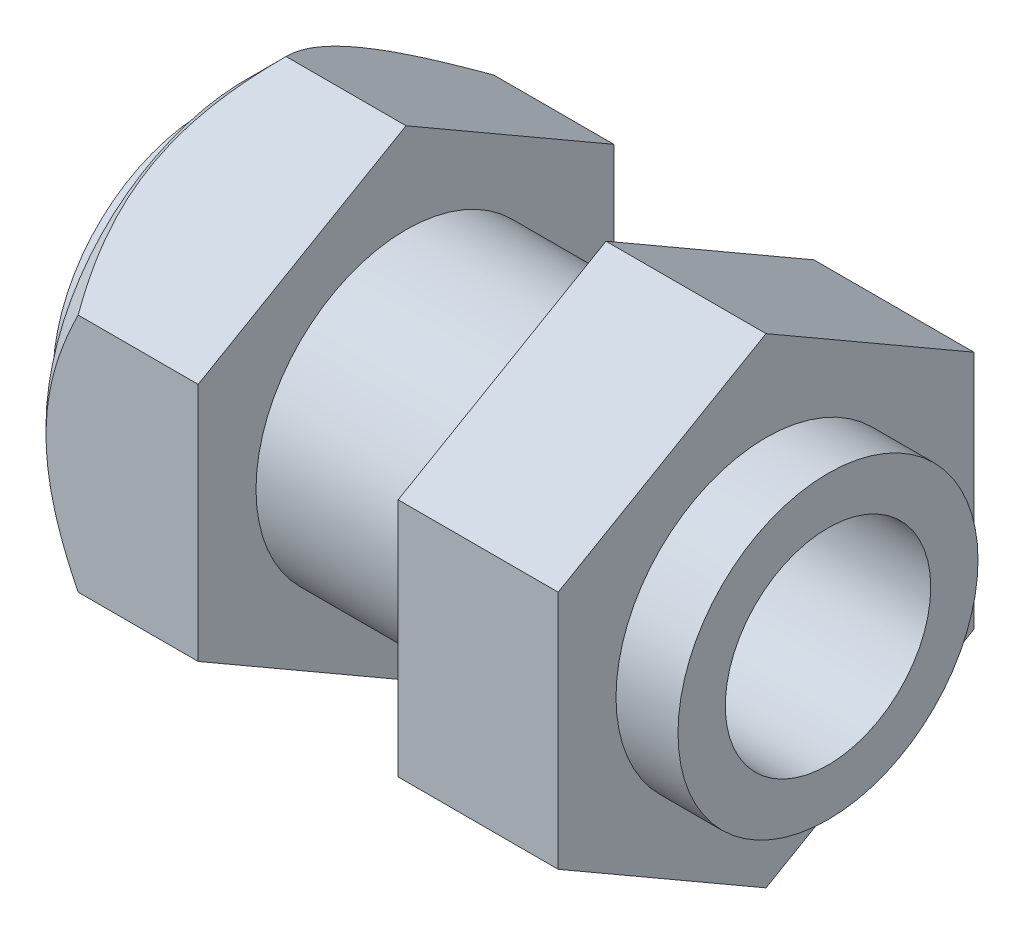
from build123d import *

# Parameters (mm, degrees)
CHANFREIN1_SIZE         = 2
ESQUISSE2_OUTSIDE_W     = 35.65
ESQUISSE2_OUTSIDE_H     = 35.651
ENL_V_MAT_EXTRU_1_DEPTH = 205.103724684


with BuildPart() as part:
    # Esquisse1 → R_volution1 (revolve)
    with BuildSketch(Plane(origin=(0, 0, 170), x_dir=(-1, 0, 0), z_dir=(0, 0, -1)), mode=Mode.PRIVATE) as r_volution1_sk:
        Polygon((429.956854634, -62.926493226), (421.956854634, -62.926493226), (421.956854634, -67.610839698), (418.857974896, -67.610839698), (418.857974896, -69.974099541), (424.956854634, -69.974099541), (444.956854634, -69.974099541), (449.949312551, -69.974099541), (449.949312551, -67.45672103), (447.956854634, -67.45672103), (447.956854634, -63.110839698), (439.956854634, -63.110839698), (439.956854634, -67.610839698), (429.956854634, -67.610839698), align=None)
    revolve(r_volution1_sk.sketch.rotate(Axis((-429.956854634, -75.110839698, 170), (-1, 0, 0)), 90), axis=Axis((-429.956854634, -75.110839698, 170), (-1, 0, 0)))

    # Chanfrein1
    chanfrein1_edges = [part.edges().sort_by_distance(p)[0] for p in [
        (-447.956854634, -75.110839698, 182),
    ]]
    chamfer(chanfrein1_edges, length=CHANFREIN1_SIZE)

    # Esquisse2 outside → Enl_v. mat.-Extru.1 (cut, through all)
    with BuildSketch(Plane.ZY.offset(447.956854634)):
        with Locations((170, -75.1105)):
            Rectangle(ESQUISSE2_OUTSIDE_W, ESQUISSE2_OUTSIDE_H)
        Polygon((170, -63.110839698), (159.607695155, -69.110839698), (159.607695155, -81.110839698), (170, -87.110839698), (180.392304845, -81.110839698), (180.392304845, -69.110839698), align=None, mode=Mode.SUBTRACT)
    extrude(amount=-ENL_V_MAT_EXTRU_1_DEPTH, mode=Mode.SUBTRACT)


solid = part.part
